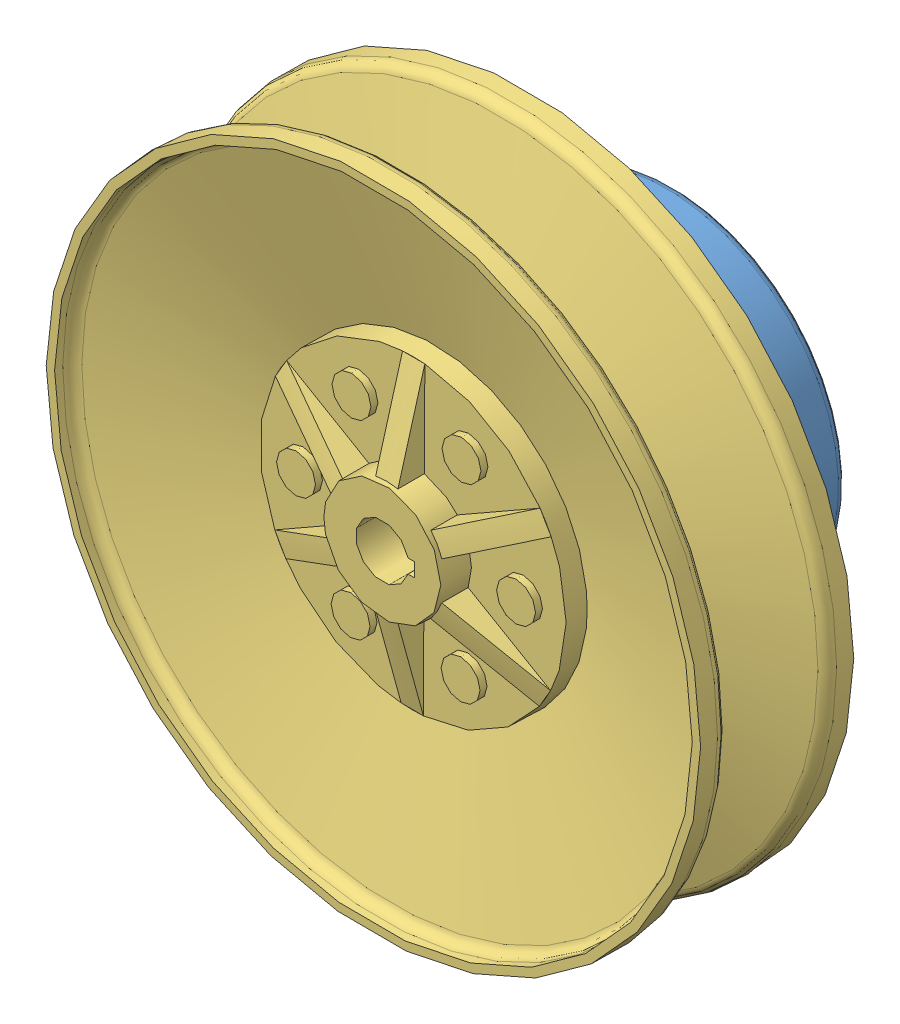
SolidWorks assembly Driver.SLDASM, configuration Predeterminado (file format 9000). Lengths in mm.
Overall size (236.09 236.09 112.49).
3 component instances, 3 part files, 3 mates.
Components (placement in the parent):
- Pista para gomas-1: Pista para gomas.SLDPRT [Predeterminado] at (61.531 -134.3909 49.9099) x (0.686466 0.727162 0) z (0.727162 -0.686466 0) size (124 48.14 124)
- Eje galga CVT-1: Eje galga CVT.SLDPRT [Predeterminado] at (61.531 -134.3909 117.0899) x (1 0 0) z (0 0 -1) size (34.8 34.8 49.18)
- Disco conducido con pista-2: Disco conducido con pista.SLDPRT [Predeterminado] at (61.531 -134.3909 127.0899) x (-0.004664 -0.999989 0) z (0.999989 -0.004664 0) size (235 81.77 235)
Mates (geometry in assembly coordinates):
- Coincidente1: coincident anti-aligned: circle of Pista para gomas-1; circle of Eje galga CVT-1
- Concéntrica1: concentric anti-aligned: circle of Eje galga CVT-1; circle of Disco conducido con pista-2
- Coincidente2: coincident aligned: circle of Eje galga CVT-1; plane of Disco conducido con pista-2 through (61.3538 -172.3905 117.0899) normal (0 0 -1)
